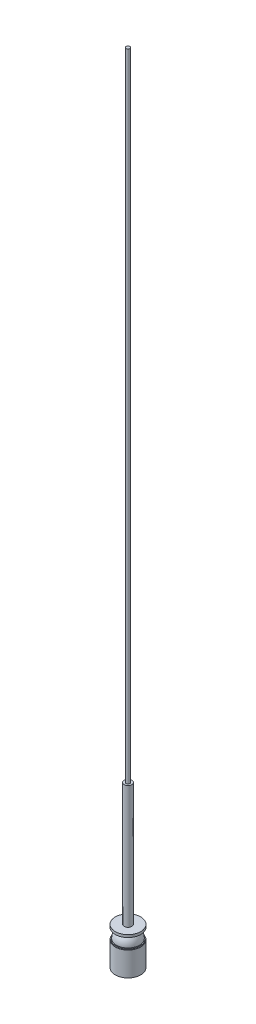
from build123d import *

# Parameters (mm, degrees)
SKETCH1_W = 6
SKETCH1_H = 193
SKETCH2_W = 20
SKETCH2_H = 4
SKETCH4_W = 3
SKETCH4_H = 1000


with BuildPart() as part:
    # Sketch1 → Revolve1 (revolve)
    with BuildSketch(Plane.XY, mode=Mode.PRIVATE) as revolve1_sk:
        with Locations((3, 96.5)):
            Rectangle(SKETCH1_W, SKETCH1_H)
    revolve(revolve1_sk.sketch.rotate(Axis((0, 0, 0), (0, 1, 0)), 90), axis=Axis((0, 0, 0), (0, 1, 0)))

    # Sketch2 → Revolve2 (revolve)
    with BuildSketch(Plane.XY, mode=Mode.PRIVATE) as revolve2_sk:
        with Locations((10, -2)):
            Rectangle(SKETCH2_W, SKETCH2_H)
    revolve(revolve2_sk.sketch.rotate(Axis((0, -4, 0), (0, 1, 0)), 90), axis=Axis((0, -4, 0), (0, 1, 0)))

    # Sketch3 → Revolve3 (revolve)
    with BuildSketch(Plane.XY, mode=Mode.PRIVATE) as revolve3_sk:
        with BuildLine():
            Line((0, -4), (0, -59))
            Line((0, -59), (20, -59))
            Line((20, -59), (20, -21))
            Line((20, -21), (19.313278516, -21))
            Line((19.313278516, -21), (19.313278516, -19.470041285))
            Line((19.313278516, -19.470041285), (18.125365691, -19.470041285))
            ThreePointArc((18.125365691, -19.470041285), (16.21059426, -10.643089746), (10.090889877, -4))
            Line((10.090889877, -4), (0, -4))
        make_face()
    revolve(revolve3_sk.sketch.rotate(Axis((0, -4, 0), (0, -1, 0)), 180), axis=Axis((0, -4, 0), (0, -1, 0)))

    # Sketch4 → Revolve4 (revolve)
    with BuildSketch(Plane.XY, mode=Mode.PRIVATE) as revolve4_sk:
        with Locations((1.5, 693)):
            Rectangle(SKETCH4_W, SKETCH4_H)
    revolve(revolve4_sk.sketch.rotate(Axis((0, 193, 0), (0, 1, 0)), 180), axis=Axis((0, 193, 0), (0, 1, 0)))


solid = part.part
